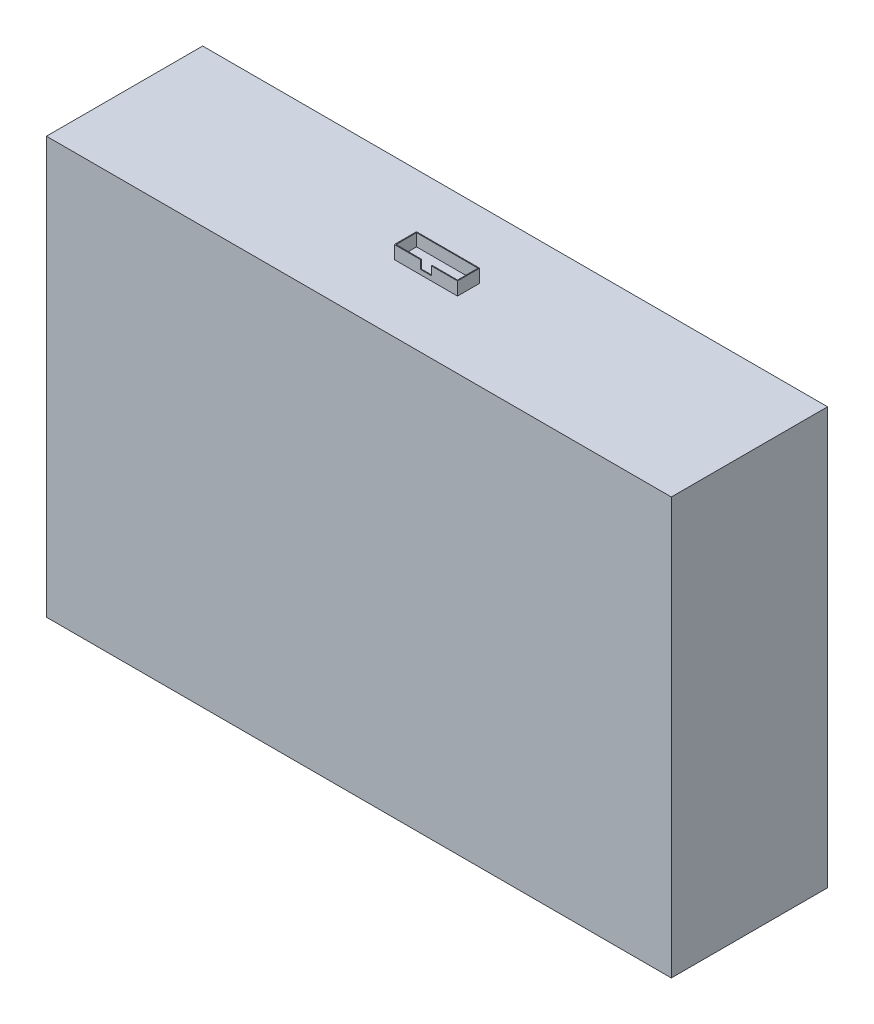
ISO-10303-21;
HEADER;
FILE_DESCRIPTION(('STEP AP214'),'2;1');
FILE_NAME('part.step','',(''),(''),'','','');
FILE_SCHEMA(('AUTOMOTIVE_DESIGN { 1 0 10303 214 1 1 1 1 }'));
ENDSEC;
DATA;
#1=APPLICATION_CONTEXT('core data for automotive mechanical design processes');
#2=APPLICATION_PROTOCOL_DEFINITION('international standard','automotive_design',2000,#1);
#3=PRODUCT_CONTEXT('',#1,'mechanical');
#4=PRODUCT('Part','Part','',(#3));
#5=PRODUCT_RELATED_PRODUCT_CATEGORY('part','',(#4));
#6=PRODUCT_DEFINITION_FORMATION('','',#4);
#7=PRODUCT_DEFINITION_CONTEXT('part definition',#1,'design');
#8=PRODUCT_DEFINITION('design','',#6,#7);
#9=PRODUCT_DEFINITION_SHAPE('','',#8);
#10=(LENGTH_UNIT() NAMED_UNIT(*) SI_UNIT(.MILLI.,.METRE.));
#11=(NAMED_UNIT(*) PLANE_ANGLE_UNIT() SI_UNIT($,.RADIAN.));
#12=(NAMED_UNIT(*) SI_UNIT($,.STERADIAN.) SOLID_ANGLE_UNIT());
#13=UNCERTAINTY_MEASURE_WITH_UNIT(LENGTH_MEASURE(1.E-05),#10,'distance_accuracy_value','');
#14=(GEOMETRIC_REPRESENTATION_CONTEXT(3) GLOBAL_UNCERTAINTY_ASSIGNED_CONTEXT((#13)) GLOBAL_UNIT_ASSIGNED_CONTEXT((#10,
#11,#12)) REPRESENTATION_CONTEXT('',''));
#15=CARTESIAN_POINT('',(0.,0.,0.));
#16=DIRECTION('',(0.,0.,1.));
#17=DIRECTION('',(1.,0.,0.));
#18=AXIS2_PLACEMENT_3D('',#15,#16,#17);
#19=CARTESIAN_POINT('',(-152.4,-203.6,-38.1));
#20=DIRECTION('',(0.,-1.,0.));
#21=DIRECTION('',(0.,0.,-1.));
#22=AXIS2_PLACEMENT_3D('',#19,#20,#21);
#23=PLANE('',#22);
#24=DIRECTION('',(0.,0.,-1.));
#25=VECTOR('',#24,1.);
#26=CARTESIAN_POINT('',(-152.4,-203.6,38.1));
#27=LINE('',#26,#25);
#28=CARTESIAN_POINT('',(-152.4,-203.6,38.1));
#29=VERTEX_POINT('',#28);
#30=CARTESIAN_POINT('',(-152.4,-203.6,-38.1));
#31=VERTEX_POINT('',#30);
#32=EDGE_CURVE('E160',#29,#31,#27,.T.);
#33=ORIENTED_EDGE('',*,*,#32,.T.);
#34=DIRECTION('',(1.,0.,0.));
#35=VECTOR('',#34,1.);
#36=CARTESIAN_POINT('',(-152.4,-203.6,-38.1));
#37=LINE('',#36,#35);
#38=CARTESIAN_POINT('',(152.4,-203.6,-38.1));
#39=VERTEX_POINT('',#38);
#40=EDGE_CURVE('E149',#31,#39,#37,.T.);
#41=ORIENTED_EDGE('',*,*,#40,.T.);
#42=DIRECTION('',(0.,0.,1.));
#43=VECTOR('',#42,1.);
#44=CARTESIAN_POINT('',(152.4,-203.6,38.1));
#45=LINE('',#44,#43);
#46=CARTESIAN_POINT('',(152.4,-203.6,38.1));
#47=VERTEX_POINT('',#46);
#48=EDGE_CURVE('E159',#39,#47,#45,.T.);
#49=ORIENTED_EDGE('',*,*,#48,.T.);
#50=DIRECTION('',(-1.,0.,0.));
#51=VECTOR('',#50,1.);
#52=CARTESIAN_POINT('',(-152.4,-203.6,38.1));
#53=LINE('',#52,#51);
#54=EDGE_CURVE('E165',#47,#29,#53,.T.);
#55=ORIENTED_EDGE('',*,*,#54,.T.);
#56=EDGE_LOOP('',(#33,#41,#49,#55));
#57=FACE_BOUND('',#56,.T.);
#58=CARTESIAN_POINT('',(-102.411177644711,-203.6,0.));
#59=DIRECTION('',(0.,-1.,0.));
#60=DIRECTION('',(0.,0.,-1.));
#61=AXIS2_PLACEMENT_3D('',#58,#59,#60);
#62=CIRCLE('',#61,21.);
#63=CARTESIAN_POINT('',(-102.411177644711,-203.6,-21.));
#64=VERTEX_POINT('',#63);
#65=EDGE_CURVE('E334',#64,#64,#62,.T.);
#66=ORIENTED_EDGE('',*,*,#65,.F.);
#67=EDGE_LOOP('',(#66));
#68=FACE_BOUND('',#67,.T.);
#69=ADVANCED_FACE('F32',(#57,#68),#23,.T.);
#70=CARTESIAN_POINT('',(-15.4,6.,-5.));
#71=DIRECTION('',(1.,0.,0.));
#72=DIRECTION('',(0.,0.,-1.));
#73=AXIS2_PLACEMENT_3D('',#70,#71,#72);
#74=PLANE('',#73);
#75=DIRECTION('',(0.,0.,1.));
#76=VECTOR('',#75,1.);
#77=CARTESIAN_POINT('',(-15.4,-0.4,-5.));
#78=LINE('',#77,#76);
#79=CARTESIAN_POINT('',(-15.4,-0.4,-5.4));
#80=VERTEX_POINT('',#79);
#81=CARTESIAN_POINT('',(-15.4,-0.4,5.4));
#82=VERTEX_POINT('',#81);
#83=EDGE_CURVE('E229',#80,#82,#78,.T.);
#84=ORIENTED_EDGE('',*,*,#83,.T.);
#85=DIRECTION('',(0.,-1.,0.));
#86=VECTOR('',#85,1.);
#87=CARTESIAN_POINT('',(-15.4,6.,5.4));
#88=LINE('',#87,#86);
#89=CARTESIAN_POINT('',(-15.4,6.,5.4));
#90=VERTEX_POINT('',#89);
#91=EDGE_CURVE('E11',#90,#82,#88,.T.);
#92=ORIENTED_EDGE('',*,*,#91,.F.);
#93=DIRECTION('',(0.,0.,1.));
#94=VECTOR('',#93,1.);
#95=CARTESIAN_POINT('',(-15.4,6.,-5.));
#96=LINE('',#95,#94);
#97=CARTESIAN_POINT('',(-15.4,6.,-5.4));
#98=VERTEX_POINT('',#97);
#99=EDGE_CURVE('E249',#98,#90,#96,.T.);
#100=ORIENTED_EDGE('',*,*,#99,.F.);
#101=DIRECTION('',(0.,-1.,0.));
#102=VECTOR('',#101,1.);
#103=CARTESIAN_POINT('',(-15.4,6.,-5.4));
#104=LINE('',#103,#102);
#105=EDGE_CURVE('E233',#98,#80,#104,.T.);
#106=ORIENTED_EDGE('',*,*,#105,.T.);
#107=EDGE_LOOP('',(#84,#92,#100,#106));
#108=FACE_BOUND('',#107,.T.);
#109=ADVANCED_FACE('F266',(#108),#74,.F.);
#110=CARTESIAN_POINT('',(-15.,6.,5.4));
#111=DIRECTION('',(0.,0.,-1.));
#112=DIRECTION('',(-1.,0.,0.));
#113=AXIS2_PLACEMENT_3D('',#110,#111,#112);
#114=PLANE('',#113);
#115=DIRECTION('',(1.,0.,0.));
#116=VECTOR('',#115,1.);
#117=CARTESIAN_POINT('',(2.625,1.84856815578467,5.4));
#118=LINE('',#117,#116);
#119=CARTESIAN_POINT('',(-2.625,1.84856815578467,5.4));
#120=VERTEX_POINT('',#119);
#121=CARTESIAN_POINT('',(2.625,1.84856815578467,5.4));
#122=VERTEX_POINT('',#121);
#123=EDGE_CURVE('E182',#120,#122,#118,.T.);
#124=ORIENTED_EDGE('',*,*,#123,.F.);
#125=DIRECTION('',(0.,-1.,0.));
#126=VECTOR('',#125,1.);
#127=CARTESIAN_POINT('',(-2.625,6.,5.4));
#128=LINE('',#127,#126);
#129=CARTESIAN_POINT('',(-2.625,6.,5.4));
#130=VERTEX_POINT('',#129);
#131=EDGE_CURVE('E184',#130,#120,#128,.T.);
#132=ORIENTED_EDGE('',*,*,#131,.F.);
#133=DIRECTION('',(1.,0.,0.));
#134=VECTOR('',#133,1.);
#135=CARTESIAN_POINT('',(-15.,6.,5.4));
#136=LINE('',#135,#134);
#137=EDGE_CURVE('E253',#90,#130,#136,.T.);
#138=ORIENTED_EDGE('',*,*,#137,.F.);
#139=ORIENTED_EDGE('',*,*,#91,.T.);
#140=DIRECTION('',(1.,0.,0.));
#141=VECTOR('',#140,1.);
#142=CARTESIAN_POINT('',(-15.,-0.4,5.4));
#143=LINE('',#142,#141);
#144=CARTESIAN_POINT('',(15.4,-0.4,5.4));
#145=VERTEX_POINT('',#144);
#146=EDGE_CURVE('E231',#82,#145,#143,.T.);
#147=ORIENTED_EDGE('',*,*,#146,.T.);
#148=DIRECTION('',(0.,-1.,0.));
#149=VECTOR('',#148,1.);
#150=CARTESIAN_POINT('',(15.4,6.,5.4));
#151=LINE('',#150,#149);
#152=CARTESIAN_POINT('',(15.4,6.,5.4));
#153=VERTEX_POINT('',#152);
#154=EDGE_CURVE('E41',#153,#145,#151,.T.);
#155=ORIENTED_EDGE('',*,*,#154,.F.);
#156=CARTESIAN_POINT('',(2.625,6.,5.4));
#157=VERTEX_POINT('',#156);
#158=EDGE_CURVE('E252',#157,#153,#136,.T.);
#159=ORIENTED_EDGE('',*,*,#158,.F.);
#160=DIRECTION('',(0.,1.,0.));
#161=VECTOR('',#160,1.);
#162=CARTESIAN_POINT('',(2.625,6.,5.4));
#163=LINE('',#162,#161);
#164=EDGE_CURVE('E186',#122,#157,#163,.T.);
#165=ORIENTED_EDGE('',*,*,#164,.F.);
#166=EDGE_LOOP('',(#124,#132,#138,#139,#147,#155,#159,#165));
#167=FACE_BOUND('',#166,.T.);
#168=ADVANCED_FACE('F269',(#167),#114,.F.);
#169=CARTESIAN_POINT('',(15.4,6.,-5.));
#170=DIRECTION('',(-1.,0.,0.));
#171=DIRECTION('',(0.,0.,1.));
#172=AXIS2_PLACEMENT_3D('',#169,#170,#171);
#173=PLANE('',#172);
#174=DIRECTION('',(0.,0.,-1.));
#175=VECTOR('',#174,1.);
#176=CARTESIAN_POINT('',(15.4,-0.4,-5.));
#177=LINE('',#176,#175);
#178=CARTESIAN_POINT('',(15.4,-0.4,-5.4));
#179=VERTEX_POINT('',#178);
#180=EDGE_CURVE('E239',#145,#179,#177,.T.);
#181=ORIENTED_EDGE('',*,*,#180,.T.);
#182=DIRECTION('',(0.,-1.,0.));
#183=VECTOR('',#182,1.);
#184=CARTESIAN_POINT('',(15.4,6.,-5.4));
#185=LINE('',#184,#183);
#186=CARTESIAN_POINT('',(15.4,6.,-5.4));
#187=VERTEX_POINT('',#186);
#188=EDGE_CURVE('E236',#187,#179,#185,.T.);
#189=ORIENTED_EDGE('',*,*,#188,.F.);
#190=DIRECTION('',(0.,0.,-1.));
#191=VECTOR('',#190,1.);
#192=CARTESIAN_POINT('',(15.4,6.,-5.));
#193=LINE('',#192,#191);
#194=EDGE_CURVE('E255',#153,#187,#193,.T.);
#195=ORIENTED_EDGE('',*,*,#194,.F.);
#196=ORIENTED_EDGE('',*,*,#154,.T.);
#197=EDGE_LOOP('',(#181,#189,#195,#196));
#198=FACE_BOUND('',#197,.T.);
#199=ADVANCED_FACE('F300',(#198),#173,.F.);
#200=CARTESIAN_POINT('',(-15.,6.,-5.4));
#201=DIRECTION('',(0.,0.,1.));
#202=DIRECTION('',(1.,0.,0.));
#203=AXIS2_PLACEMENT_3D('',#200,#201,#202);
#204=PLANE('',#203);
#205=DIRECTION('',(-1.,0.,0.));
#206=VECTOR('',#205,1.);
#207=CARTESIAN_POINT('',(-15.,-0.4,-5.4));
#208=LINE('',#207,#206);
#209=EDGE_CURVE('E244',#179,#80,#208,.T.);
#210=ORIENTED_EDGE('',*,*,#209,.T.);
#211=ORIENTED_EDGE('',*,*,#105,.F.);
#212=DIRECTION('',(-1.,0.,0.));
#213=VECTOR('',#212,1.);
#214=CARTESIAN_POINT('',(-15.,6.,-5.4));
#215=LINE('',#214,#213);
#216=EDGE_CURVE('E36',#187,#98,#215,.T.);
#217=ORIENTED_EDGE('',*,*,#216,.F.);
#218=ORIENTED_EDGE('',*,*,#188,.T.);
#219=EDGE_LOOP('',(#210,#211,#217,#218));
#220=FACE_BOUND('',#219,.T.);
#221=ADVANCED_FACE('F34',(#220),#204,.F.);
#222=CARTESIAN_POINT('',(-15.,6.,5.));
#223=DIRECTION('',(0.,1.,0.));
#224=DIRECTION('',(0.,0.,1.));
#225=AXIS2_PLACEMENT_3D('',#222,#223,#224);
#226=PLANE('',#225);
#227=DIRECTION('',(0.,0.,-1.));
#228=VECTOR('',#227,1.);
#229=CARTESIAN_POINT('',(-2.625,6.,12.0930476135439));
#230=LINE('',#229,#228);
#231=CARTESIAN_POINT('',(-2.625,6.,5.));
#232=VERTEX_POINT('',#231);
#233=EDGE_CURVE('E185',#130,#232,#230,.T.);
#234=ORIENTED_EDGE('',*,*,#233,.T.);
#235=DIRECTION('',(1.,0.,0.));
#236=VECTOR('',#235,1.);
#237=CARTESIAN_POINT('',(-15.,6.,5.));
#238=LINE('',#237,#236);
#239=CARTESIAN_POINT('',(-15.,6.,5.));
#240=VERTEX_POINT('',#239);
#241=EDGE_CURVE('E205',#240,#232,#238,.T.);
#242=ORIENTED_EDGE('',*,*,#241,.F.);
#243=DIRECTION('',(0.,0.,1.));
#244=VECTOR('',#243,1.);
#245=CARTESIAN_POINT('',(-15.,6.,-5.));
#246=LINE('',#245,#244);
#247=CARTESIAN_POINT('',(-15.,6.,-5.));
#248=VERTEX_POINT('',#247);
#249=EDGE_CURVE('E201',#248,#240,#246,.T.);
#250=ORIENTED_EDGE('',*,*,#249,.F.);
#251=DIRECTION('',(-1.,0.,0.));
#252=VECTOR('',#251,1.);
#253=CARTESIAN_POINT('',(-15.,6.,-5.));
#254=LINE('',#253,#252);
#255=CARTESIAN_POINT('',(15.,6.,-5.));
#256=VERTEX_POINT('',#255);
#257=EDGE_CURVE('E210',#256,#248,#254,.T.);
#258=ORIENTED_EDGE('',*,*,#257,.F.);
#259=DIRECTION('',(0.,0.,-1.));
#260=VECTOR('',#259,1.);
#261=CARTESIAN_POINT('',(15.,6.,-5.));
#262=LINE('',#261,#260);
#263=CARTESIAN_POINT('',(15.,6.,5.));
#264=VERTEX_POINT('',#263);
#265=EDGE_CURVE('E208',#264,#256,#262,.T.);
#266=ORIENTED_EDGE('',*,*,#265,.F.);
#267=CARTESIAN_POINT('',(2.625,6.,5.));
#268=VERTEX_POINT('',#267);
#269=EDGE_CURVE('E203',#268,#264,#238,.T.);
#270=ORIENTED_EDGE('',*,*,#269,.F.);
#271=DIRECTION('',(0.,0.,-1.));
#272=VECTOR('',#271,1.);
#273=CARTESIAN_POINT('',(2.625,6.,12.0930476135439));
#274=LINE('',#273,#272);
#275=EDGE_CURVE('E49',#157,#268,#274,.T.);
#276=ORIENTED_EDGE('',*,*,#275,.F.);
#277=ORIENTED_EDGE('',*,*,#158,.T.);
#278=ORIENTED_EDGE('',*,*,#194,.T.);
#279=ORIENTED_EDGE('',*,*,#216,.T.);
#280=ORIENTED_EDGE('',*,*,#99,.T.);
#281=ORIENTED_EDGE('',*,*,#137,.T.);
#282=EDGE_LOOP('',(#234,#242,#250,#258,#266,#270,#276,#277,#278,#279,#280,#281));
#283=FACE_BOUND('',#282,.T.);
#284=ADVANCED_FACE('F261',(#283),#226,.T.);
#285=CARTESIAN_POINT('',(-15.,6.,-5.));
#286=DIRECTION('',(1.,0.,0.));
#287=DIRECTION('',(0.,0.,-1.));
#288=AXIS2_PLACEMENT_3D('',#285,#286,#287);
#289=PLANE('',#288);
#290=DIRECTION('',(0.,0.,1.));
#291=VECTOR('',#290,1.);
#292=CARTESIAN_POINT('',(-15.,0.,-5.));
#293=LINE('',#292,#291);
#294=CARTESIAN_POINT('',(-15.,0.,-5.));
#295=VERTEX_POINT('',#294);
#296=CARTESIAN_POINT('',(-15.,0.,5.));
#297=VERTEX_POINT('',#296);
#298=EDGE_CURVE('E200',#295,#297,#293,.T.);
#299=ORIENTED_EDGE('',*,*,#298,.F.);
#300=DIRECTION('',(0.,-1.,0.));
#301=VECTOR('',#300,1.);
#302=CARTESIAN_POINT('',(-15.,6.,-5.));
#303=LINE('',#302,#301);
#304=EDGE_CURVE('E212',#248,#295,#303,.T.);
#305=ORIENTED_EDGE('',*,*,#304,.F.);
#306=ORIENTED_EDGE('',*,*,#249,.T.);
#307=DIRECTION('',(0.,-1.,0.));
#308=VECTOR('',#307,1.);
#309=CARTESIAN_POINT('',(-15.,6.,5.));
#310=LINE('',#309,#308);
#311=EDGE_CURVE('E226',#240,#297,#310,.T.);
#312=ORIENTED_EDGE('',*,*,#311,.T.);
#313=EDGE_LOOP('',(#299,#305,#306,#312));
#314=FACE_BOUND('',#313,.T.);
#315=ADVANCED_FACE('F282',(#314),#289,.T.);
#316=CARTESIAN_POINT('',(-15.,6.,5.));
#317=DIRECTION('',(0.,0.,-1.));
#318=DIRECTION('',(-1.,0.,0.));
#319=AXIS2_PLACEMENT_3D('',#316,#317,#318);
#320=PLANE('',#319);
#321=DIRECTION('',(0.,1.,0.));
#322=VECTOR('',#321,1.);
#323=CARTESIAN_POINT('',(-2.625,6.,5.));
#324=LINE('',#323,#322);
#325=CARTESIAN_POINT('',(-2.625,1.84856815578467,5.));
#326=VERTEX_POINT('',#325);
#327=EDGE_CURVE('E190',#326,#232,#324,.T.);
#328=ORIENTED_EDGE('',*,*,#327,.F.);
#329=DIRECTION('',(-1.,0.,0.));
#330=VECTOR('',#329,1.);
#331=CARTESIAN_POINT('',(2.625,1.84856815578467,5.));
#332=LINE('',#331,#330);
#333=CARTESIAN_POINT('',(2.625,1.84856815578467,5.));
#334=VERTEX_POINT('',#333);
#335=EDGE_CURVE('E176',#334,#326,#332,.T.);
#336=ORIENTED_EDGE('',*,*,#335,.F.);
#337=DIRECTION('',(0.,-1.,0.));
#338=VECTOR('',#337,1.);
#339=CARTESIAN_POINT('',(2.625,6.,5.));
#340=LINE('',#339,#338);
#341=EDGE_CURVE('E174',#268,#334,#340,.T.);
#342=ORIENTED_EDGE('',*,*,#341,.F.);
#343=ORIENTED_EDGE('',*,*,#269,.T.);
#344=DIRECTION('',(0.,-1.,0.));
#345=VECTOR('',#344,1.);
#346=CARTESIAN_POINT('',(15.,6.,5.));
#347=LINE('',#346,#345);
#348=CARTESIAN_POINT('',(15.,0.,5.));
#349=VERTEX_POINT('',#348);
#350=EDGE_CURVE('E223',#264,#349,#347,.T.);
#351=ORIENTED_EDGE('',*,*,#350,.T.);
#352=DIRECTION('',(1.,0.,0.));
#353=VECTOR('',#352,1.);
#354=CARTESIAN_POINT('',(-15.,0.,5.));
#355=LINE('',#354,#353);
#356=EDGE_CURVE('E215',#297,#349,#355,.T.);
#357=ORIENTED_EDGE('',*,*,#356,.F.);
#358=ORIENTED_EDGE('',*,*,#311,.F.);
#359=ORIENTED_EDGE('',*,*,#241,.T.);
#360=EDGE_LOOP('',(#328,#336,#342,#343,#351,#357,#358,#359));
#361=FACE_BOUND('',#360,.T.);
#362=ADVANCED_FACE('F278',(#361),#320,.T.);
#363=CARTESIAN_POINT('',(15.,6.,-5.));
#364=DIRECTION('',(-1.,0.,0.));
#365=DIRECTION('',(0.,0.,1.));
#366=AXIS2_PLACEMENT_3D('',#363,#364,#365);
#367=PLANE('',#366);
#368=DIRECTION('',(0.,0.,-1.));
#369=VECTOR('',#368,1.);
#370=CARTESIAN_POINT('',(15.,0.,-5.));
#371=LINE('',#370,#369);
#372=CARTESIAN_POINT('',(15.,0.,-5.));
#373=VERTEX_POINT('',#372);
#374=EDGE_CURVE('E217',#349,#373,#371,.T.);
#375=ORIENTED_EDGE('',*,*,#374,.F.);
#376=ORIENTED_EDGE('',*,*,#350,.F.);
#377=ORIENTED_EDGE('',*,*,#265,.T.);
#378=DIRECTION('',(0.,-1.,0.));
#379=VECTOR('',#378,1.);
#380=CARTESIAN_POINT('',(15.,6.,-5.));
#381=LINE('',#380,#379);
#382=EDGE_CURVE('E57',#256,#373,#381,.T.);
#383=ORIENTED_EDGE('',*,*,#382,.T.);
#384=EDGE_LOOP('',(#375,#376,#377,#383));
#385=FACE_BOUND('',#384,.T.);
#386=ADVANCED_FACE('F293',(#385),#367,.T.);
#387=CARTESIAN_POINT('',(-15.,6.,-5.));
#388=DIRECTION('',(0.,0.,1.));
#389=DIRECTION('',(1.,0.,0.));
#390=AXIS2_PLACEMENT_3D('',#387,#388,#389);
#391=PLANE('',#390);
#392=DIRECTION('',(-1.,0.,0.));
#393=VECTOR('',#392,1.);
#394=CARTESIAN_POINT('',(-15.,0.,-5.));
#395=LINE('',#394,#393);
#396=EDGE_CURVE('E204',#373,#295,#395,.T.);
#397=ORIENTED_EDGE('',*,*,#396,.F.);
#398=ORIENTED_EDGE('',*,*,#382,.F.);
#399=ORIENTED_EDGE('',*,*,#257,.T.);
#400=ORIENTED_EDGE('',*,*,#304,.T.);
#401=EDGE_LOOP('',(#397,#398,#399,#400));
#402=FACE_BOUND('',#401,.T.);
#403=ADVANCED_FACE('F287',(#402),#391,.T.);
#404=CARTESIAN_POINT('',(-15.,0.,5.));
#405=DIRECTION('',(0.,1.,0.));
#406=DIRECTION('',(0.,0.,1.));
#407=AXIS2_PLACEMENT_3D('',#404,#405,#406);
#408=PLANE('',#407);
#409=ORIENTED_EDGE('',*,*,#298,.T.);
#410=ORIENTED_EDGE('',*,*,#356,.T.);
#411=ORIENTED_EDGE('',*,*,#374,.T.);
#412=ORIENTED_EDGE('',*,*,#396,.T.);
#413=EDGE_LOOP('',(#409,#410,#411,#412));
#414=FACE_BOUND('',#413,.T.);
#415=ADVANCED_FACE('F285',(#414),#408,.T.);
#416=CARTESIAN_POINT('',(-2.625,6.,12.0930476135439));
#417=DIRECTION('',(-1.,0.,0.));
#418=DIRECTION('',(0.,0.,1.));
#419=AXIS2_PLACEMENT_3D('',#416,#417,#418);
#420=PLANE('',#419);
#421=ORIENTED_EDGE('',*,*,#131,.T.);
#422=DIRECTION('',(0.,0.,-1.));
#423=VECTOR('',#422,1.);
#424=CARTESIAN_POINT('',(-2.625,1.84856815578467,12.0930476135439));
#425=LINE('',#424,#423);
#426=EDGE_CURVE('E194',#120,#326,#425,.T.);
#427=ORIENTED_EDGE('',*,*,#426,.T.);
#428=ORIENTED_EDGE('',*,*,#327,.T.);
#429=ORIENTED_EDGE('',*,*,#233,.F.);
#430=EDGE_LOOP('',(#421,#427,#428,#429));
#431=FACE_BOUND('',#430,.T.);
#432=ADVANCED_FACE('F363',(#431),#420,.F.);
#433=CARTESIAN_POINT('',(2.625,1.84856815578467,12.0930476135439));
#434=DIRECTION('',(0.,-1.,0.));
#435=DIRECTION('',(1.,0.,0.));
#436=AXIS2_PLACEMENT_3D('',#433,#434,#435);
#437=PLANE('',#436);
#438=ORIENTED_EDGE('',*,*,#123,.T.);
#439=DIRECTION('',(0.,0.,-1.));
#440=VECTOR('',#439,1.);
#441=CARTESIAN_POINT('',(2.625,1.84856815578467,12.0930476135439));
#442=LINE('',#441,#440);
#443=EDGE_CURVE('E196',#122,#334,#442,.T.);
#444=ORIENTED_EDGE('',*,*,#443,.T.);
#445=ORIENTED_EDGE('',*,*,#335,.T.);
#446=ORIENTED_EDGE('',*,*,#426,.F.);
#447=EDGE_LOOP('',(#438,#444,#445,#446));
#448=FACE_BOUND('',#447,.T.);
#449=ADVANCED_FACE('F311',(#448),#437,.F.);
#450=CARTESIAN_POINT('',(2.625,6.,12.0930476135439));
#451=DIRECTION('',(1.,0.,0.));
#452=DIRECTION('',(0.,1.,0.));
#453=AXIS2_PLACEMENT_3D('',#450,#451,#452);
#454=PLANE('',#453);
#455=ORIENTED_EDGE('',*,*,#164,.T.);
#456=ORIENTED_EDGE('',*,*,#275,.T.);
#457=ORIENTED_EDGE('',*,*,#341,.T.);
#458=ORIENTED_EDGE('',*,*,#443,.F.);
#459=EDGE_LOOP('',(#455,#456,#457,#458));
#460=FACE_BOUND('',#459,.T.);
#461=ADVANCED_FACE('F295',(#460),#454,.F.);
#462=CARTESIAN_POINT('',(-152.4,-0.4,-38.1));
#463=DIRECTION('',(0.,-1.,0.));
#464=DIRECTION('',(0.,0.,-1.));
#465=AXIS2_PLACEMENT_3D('',#462,#463,#464);
#466=PLANE('',#465);
#467=DIRECTION('',(0.,0.,-1.));
#468=VECTOR('',#467,1.);
#469=CARTESIAN_POINT('',(-152.4,-0.4,38.1));
#470=LINE('',#469,#468);
#471=CARTESIAN_POINT('',(-152.4,-0.4,38.1));
#472=VERTEX_POINT('',#471);
#473=CARTESIAN_POINT('',(-152.4,-0.4,-38.1));
#474=VERTEX_POINT('',#473);
#475=EDGE_CURVE('E173',#472,#474,#470,.T.);
#476=ORIENTED_EDGE('',*,*,#475,.F.);
#477=DIRECTION('',(-1.,0.,0.));
#478=VECTOR('',#477,1.);
#479=CARTESIAN_POINT('',(-152.4,-0.4,38.1));
#480=LINE('',#479,#478);
#481=CARTESIAN_POINT('',(152.4,-0.4,38.1));
#482=VERTEX_POINT('',#481);
#483=EDGE_CURVE('E169',#482,#472,#480,.T.);
#484=ORIENTED_EDGE('',*,*,#483,.F.);
#485=DIRECTION('',(0.,0.,1.));
#486=VECTOR('',#485,1.);
#487=CARTESIAN_POINT('',(152.4,-0.4,38.1));
#488=LINE('',#487,#486);
#489=CARTESIAN_POINT('',(152.4,-0.4,-38.1));
#490=VERTEX_POINT('',#489);
#491=EDGE_CURVE('E345',#490,#482,#488,.T.);
#492=ORIENTED_EDGE('',*,*,#491,.F.);
#493=DIRECTION('',(1.,0.,0.));
#494=VECTOR('',#493,1.);
#495=CARTESIAN_POINT('',(-152.4,-0.4,-38.1));
#496=LINE('',#495,#494);
#497=EDGE_CURVE('E336',#474,#490,#496,.T.);
#498=ORIENTED_EDGE('',*,*,#497,.F.);
#499=EDGE_LOOP('',(#476,#484,#492,#498));
#500=FACE_BOUND('',#499,.T.);
#501=ORIENTED_EDGE('',*,*,#146,.F.);
#502=ORIENTED_EDGE('',*,*,#83,.F.);
#503=ORIENTED_EDGE('',*,*,#209,.F.);
#504=ORIENTED_EDGE('',*,*,#180,.F.);
#505=EDGE_LOOP('',(#501,#502,#503,#504));
#506=FACE_BOUND('',#505,.T.);
#507=ADVANCED_FACE('F302',(#500,#506),#466,.F.);
#508=CARTESIAN_POINT('',(-152.4,-203.6,38.1));
#509=DIRECTION('',(1.,0.,0.));
#510=DIRECTION('',(0.,0.,-1.));
#511=AXIS2_PLACEMENT_3D('',#508,#509,#510);
#512=PLANE('',#511);
#513=ORIENTED_EDGE('',*,*,#475,.T.);
#514=DIRECTION('',(0.,1.,0.));
#515=VECTOR('',#514,1.);
#516=CARTESIAN_POINT('',(-152.4,-203.6,-38.1));
#517=LINE('',#516,#515);
#518=EDGE_CURVE('E153',#31,#474,#517,.T.);
#519=ORIENTED_EDGE('',*,*,#518,.F.);
#520=ORIENTED_EDGE('',*,*,#32,.F.);
#521=DIRECTION('',(0.,1.,0.));
#522=VECTOR('',#521,1.);
#523=CARTESIAN_POINT('',(-152.4,-203.6,38.1));
#524=LINE('',#523,#522);
#525=EDGE_CURVE('E342',#29,#472,#524,.T.);
#526=ORIENTED_EDGE('',*,*,#525,.T.);
#527=EDGE_LOOP('',(#513,#519,#520,#526));
#528=FACE_BOUND('',#527,.T.);
#529=ADVANCED_FACE('F171',(#528),#512,.F.);
#530=CARTESIAN_POINT('',(-152.4,-203.6,-38.1));
#531=DIRECTION('',(0.,0.,1.));
#532=DIRECTION('',(1.,0.,0.));
#533=AXIS2_PLACEMENT_3D('',#530,#531,#532);
#534=PLANE('',#533);
#535=ORIENTED_EDGE('',*,*,#497,.T.);
#536=DIRECTION('',(0.,1.,0.));
#537=VECTOR('',#536,1.);
#538=CARTESIAN_POINT('',(152.4,-203.6,-38.1));
#539=LINE('',#538,#537);
#540=EDGE_CURVE('E156',#39,#490,#539,.T.);
#541=ORIENTED_EDGE('',*,*,#540,.F.);
#542=ORIENTED_EDGE('',*,*,#40,.F.);
#543=ORIENTED_EDGE('',*,*,#518,.T.);
#544=EDGE_LOOP('',(#535,#541,#542,#543));
#545=FACE_BOUND('',#544,.T.);
#546=ADVANCED_FACE('F151',(#545),#534,.F.);
#547=CARTESIAN_POINT('',(152.4,-203.6,38.1));
#548=DIRECTION('',(-1.,0.,0.));
#549=DIRECTION('',(0.,0.,1.));
#550=AXIS2_PLACEMENT_3D('',#547,#548,#549);
#551=PLANE('',#550);
#552=ORIENTED_EDGE('',*,*,#491,.T.);
#553=DIRECTION('',(0.,1.,0.));
#554=VECTOR('',#553,1.);
#555=CARTESIAN_POINT('',(152.4,-203.6,38.1));
#556=LINE('',#555,#554);
#557=EDGE_CURVE('E178',#47,#482,#556,.T.);
#558=ORIENTED_EDGE('',*,*,#557,.F.);
#559=ORIENTED_EDGE('',*,*,#48,.F.);
#560=ORIENTED_EDGE('',*,*,#540,.T.);
#561=EDGE_LOOP('',(#552,#558,#559,#560));
#562=FACE_BOUND('',#561,.T.);
#563=ADVANCED_FACE('F354',(#562),#551,.F.);
#564=CARTESIAN_POINT('',(-152.4,-203.6,38.1));
#565=DIRECTION('',(0.,0.,-1.));
#566=DIRECTION('',(-1.,0.,0.));
#567=AXIS2_PLACEMENT_3D('',#564,#565,#566);
#568=PLANE('',#567);
#569=ORIENTED_EDGE('',*,*,#483,.T.);
#570=ORIENTED_EDGE('',*,*,#525,.F.);
#571=ORIENTED_EDGE('',*,*,#54,.F.);
#572=ORIENTED_EDGE('',*,*,#557,.T.);
#573=EDGE_LOOP('',(#569,#570,#571,#572));
#574=FACE_BOUND('',#573,.T.);
#575=ADVANCED_FACE('F325',(#574),#568,.F.);
#576=CARTESIAN_POINT('',(-102.411177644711,-213.6,0.));
#577=DIRECTION('',(0.,1.,0.));
#578=DIRECTION('',(0.,0.,1.));
#579=AXIS2_PLACEMENT_3D('',#576,#577,#578);
#580=CYLINDRICAL_SURFACE('',#579,21.);
#581=CARTESIAN_POINT('',(-102.411177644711,-213.6,0.));
#582=DIRECTION('',(0.,-1.,0.));
#583=DIRECTION('',(0.,0.,-1.));
#584=AXIS2_PLACEMENT_3D('',#581,#582,#583);
#585=CIRCLE('',#584,21.);
#586=CARTESIAN_POINT('',(-102.411177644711,-213.6,-21.));
#587=VERTEX_POINT('',#586);
#588=EDGE_CURVE('E333',#587,#587,#585,.T.);
#589=ORIENTED_EDGE('',*,*,#588,.F.);
#590=EDGE_LOOP('',(#589));
#591=FACE_BOUND('',#590,.T.);
#592=ORIENTED_EDGE('',*,*,#65,.T.);
#593=EDGE_LOOP('',(#592));
#594=FACE_BOUND('',#593,.T.);
#595=ADVANCED_FACE('F321',(#591,#594),#580,.T.);
#596=CARTESIAN_POINT('',(-102.411177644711,-213.6,0.));
#597=DIRECTION('',(0.,-1.,0.));
#598=DIRECTION('',(0.,0.,-1.));
#599=AXIS2_PLACEMENT_3D('',#596,#597,#598);
#600=PLANE('',#599);
#601=ORIENTED_EDGE('',*,*,#588,.T.);
#602=EDGE_LOOP('',(#601));
#603=FACE_BOUND('',#602,.T.);
#604=ADVANCED_FACE('F324',(#603),#600,.T.);
#605=CLOSED_SHELL('',(#69,#109,#168,#199,#221,#284,#315,#362,#386,#403,#415,#432,#449,#461,#507,
#529,#546,#563,#575,#595,#604));
#606=MANIFOLD_SOLID_BREP('B2',#605);
#607=ADVANCED_BREP_SHAPE_REPRESENTATION('',(#18,#606),#14);
#608=SHAPE_DEFINITION_REPRESENTATION(#9,#607);
ENDSEC;
END-ISO-10303-21;
